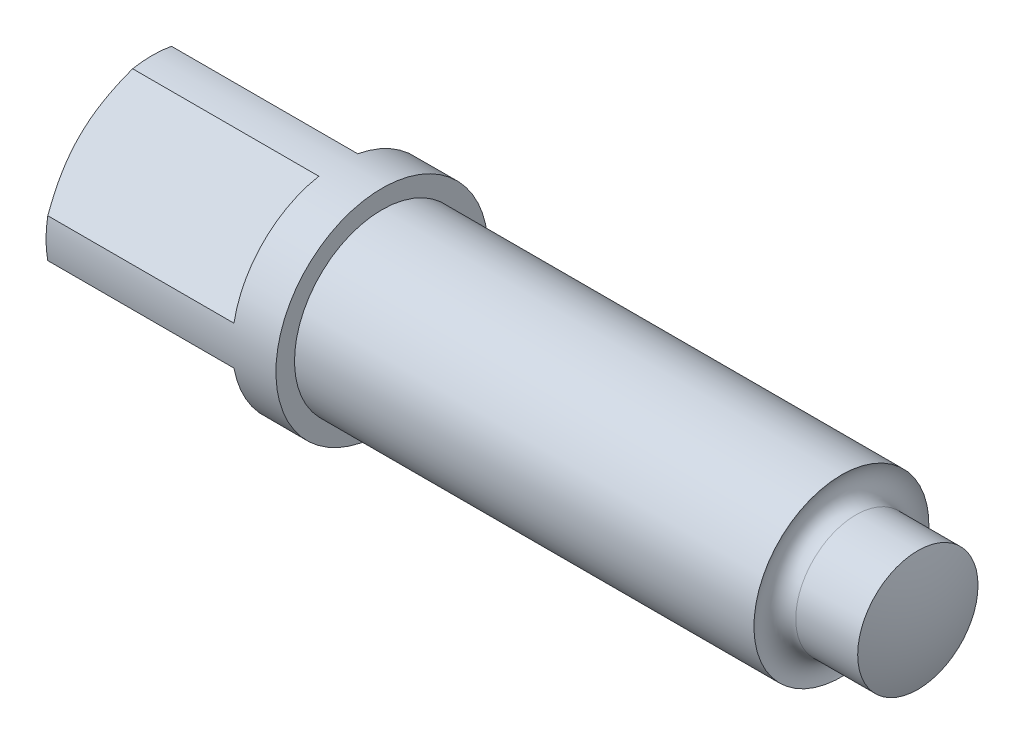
ISO-10303-21;
HEADER;
FILE_DESCRIPTION(('STEP AP214'),'2;1');
FILE_NAME('part.step','',(''),(''),'','','');
FILE_SCHEMA(('AUTOMOTIVE_DESIGN { 1 0 10303 214 1 1 1 1 }'));
ENDSEC;
DATA;
#1=APPLICATION_CONTEXT('core data for automotive mechanical design processes');
#2=APPLICATION_PROTOCOL_DEFINITION('international standard','automotive_design',2000,#1);
#3=PRODUCT_CONTEXT('',#1,'mechanical');
#4=PRODUCT('Part','Part','',(#3));
#5=PRODUCT_RELATED_PRODUCT_CATEGORY('part','',(#4));
#6=PRODUCT_DEFINITION_FORMATION('','',#4);
#7=PRODUCT_DEFINITION_CONTEXT('part definition',#1,'design');
#8=PRODUCT_DEFINITION('design','',#6,#7);
#9=PRODUCT_DEFINITION_SHAPE('','',#8);
#10=(LENGTH_UNIT() NAMED_UNIT(*) SI_UNIT(.MILLI.,.METRE.));
#11=(NAMED_UNIT(*) PLANE_ANGLE_UNIT() SI_UNIT($,.RADIAN.));
#12=(NAMED_UNIT(*) SI_UNIT($,.STERADIAN.) SOLID_ANGLE_UNIT());
#13=UNCERTAINTY_MEASURE_WITH_UNIT(LENGTH_MEASURE(1.E-05),#10,'distance_accuracy_value','');
#14=(GEOMETRIC_REPRESENTATION_CONTEXT(3) GLOBAL_UNCERTAINTY_ASSIGNED_CONTEXT((#13)) GLOBAL_UNIT_ASSIGNED_CONTEXT((#10,
#11,#12)) REPRESENTATION_CONTEXT('',''));
#15=CARTESIAN_POINT('',(0.,0.,0.));
#16=DIRECTION('',(0.,0.,1.));
#17=DIRECTION('',(1.,0.,0.));
#18=AXIS2_PLACEMENT_3D('',#15,#16,#17);
#19=CARTESIAN_POINT('',(11.,0.,0.));
#20=DIRECTION('',(1.,0.,0.));
#21=DIRECTION('',(0.,0.,-1.));
#22=AXIS2_PLACEMENT_3D('',#19,#20,#21);
#23=PLANE('',#22);
#24=CARTESIAN_POINT('',(11.,0.,0.));
#25=DIRECTION('',(1.,0.,0.));
#26=DIRECTION('',(0.,0.,-1.));
#27=AXIS2_PLACEMENT_3D('',#24,#25,#26);
#28=CIRCLE('',#27,4.85);
#29=CARTESIAN_POINT('',(11.,0.,-4.85));
#30=VERTEX_POINT('',#29);
#31=EDGE_CURVE('E381',#30,#30,#28,.T.);
#32=ORIENTED_EDGE('',*,*,#31,.T.);
#33=EDGE_LOOP('',(#32));
#34=FACE_BOUND('',#33,.T.);
#35=CARTESIAN_POINT('',(11.,0.,0.));
#36=DIRECTION('',(1.,0.,0.));
#37=DIRECTION('',(0.,1.,0.));
#38=AXIS2_PLACEMENT_3D('',#35,#36,#37);
#39=CIRCLE('',#38,4.);
#40=CARTESIAN_POINT('',(11.,4.,0.));
#41=VERTEX_POINT('',#40);
#42=EDGE_CURVE('E128',#41,#41,#39,.T.);
#43=ORIENTED_EDGE('',*,*,#42,.F.);
#44=EDGE_LOOP('',(#43));
#45=FACE_BOUND('',#44,.T.);
#46=ADVANCED_FACE('F36',(#34,#45),#23,.T.);
#47=CARTESIAN_POINT('',(11.,0.,0.));
#48=DIRECTION('',(-1.,0.,0.));
#49=DIRECTION('',(0.,0.,1.));
#50=AXIS2_PLACEMENT_3D('',#47,#48,#49);
#51=CYLINDRICAL_SURFACE('',#50,4.85);
#52=ORIENTED_EDGE('',*,*,#31,.F.);
#53=EDGE_LOOP('',(#52));
#54=FACE_BOUND('',#53,.T.);
#55=DIRECTION('',(-1.,0.,0.));
#56=VECTOR('',#55,1.);
#57=CARTESIAN_POINT('',(11.,0.889032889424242,4.76782136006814));
#58=LINE('',#57,#56);
#59=CARTESIAN_POINT('',(0.490747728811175,0.889032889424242,4.76782136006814));
#60=VERTEX_POINT('',#59);
#61=CARTESIAN_POINT('',(9.,0.889032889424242,4.76782136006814));
#62=VERTEX_POINT('',#61);
#63=EDGE_CURVE('E403',#60,#62,#58,.F.);
#64=ORIENTED_EDGE('',*,*,#63,.F.);
#65=CARTESIAN_POINT('',(0.490747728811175,0.,0.));
#66=DIRECTION('',(1.,0.,0.));
#67=DIRECTION('',(0.,1.,0.));
#68=AXIS2_PLACEMENT_3D('',#65,#66,#67);
#69=CIRCLE('',#68,4.85);
#70=CARTESIAN_POINT('',(0.490747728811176,-0.889032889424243,4.76782136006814));
#71=VERTEX_POINT('',#70);
#72=EDGE_CURVE('E137',#60,#71,#69,.T.);
#73=ORIENTED_EDGE('',*,*,#72,.T.);
#74=DIRECTION('',(-1.,0.,0.));
#75=VECTOR('',#74,1.);
#76=CARTESIAN_POINT('',(11.,-0.889032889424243,4.76782136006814));
#77=LINE('',#76,#75);
#78=CARTESIAN_POINT('',(9.,-0.889032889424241,4.76782136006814));
#79=VERTEX_POINT('',#78);
#80=EDGE_CURVE('E378',#79,#71,#77,.T.);
#81=ORIENTED_EDGE('',*,*,#80,.F.);
#82=CARTESIAN_POINT('',(9.,0.,0.));
#83=DIRECTION('',(-1.,0.,0.));
#84=DIRECTION('',(0.,0.,1.));
#85=AXIS2_PLACEMENT_3D('',#82,#83,#84);
#86=CIRCLE('',#85,4.85);
#87=CARTESIAN_POINT('',(9.,-4.76782136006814,0.889032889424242));
#88=VERTEX_POINT('',#87);
#89=EDGE_CURVE('E370',#88,#79,#86,.T.);
#90=ORIENTED_EDGE('',*,*,#89,.F.);
#91=DIRECTION('',(-1.,0.,0.));
#92=VECTOR('',#91,1.);
#93=CARTESIAN_POINT('',(11.,-4.76782136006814,0.889032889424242));
#94=LINE('',#93,#92);
#95=CARTESIAN_POINT('',(0.490747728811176,-4.76782136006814,0.889032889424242));
#96=VERTEX_POINT('',#95);
#97=EDGE_CURVE('E379',#96,#88,#94,.F.);
#98=ORIENTED_EDGE('',*,*,#97,.F.);
#99=CARTESIAN_POINT('',(0.490747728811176,-4.76782136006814,-0.889032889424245));
#100=VERTEX_POINT('',#99);
#101=EDGE_CURVE('E152',#96,#100,#69,.T.);
#102=ORIENTED_EDGE('',*,*,#101,.T.);
#103=DIRECTION('',(-1.,0.,0.));
#104=VECTOR('',#103,1.);
#105=CARTESIAN_POINT('',(11.,-4.76782136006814,-0.889032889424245));
#106=LINE('',#105,#104);
#107=CARTESIAN_POINT('',(9.,-4.76782136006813,-0.889032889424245));
#108=VERTEX_POINT('',#107);
#109=EDGE_CURVE('E385',#108,#100,#106,.T.);
#110=ORIENTED_EDGE('',*,*,#109,.F.);
#111=CARTESIAN_POINT('',(9.,-0.889032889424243,-4.76782136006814));
#112=VERTEX_POINT('',#111);
#113=EDGE_CURVE('E375',#112,#108,#86,.T.);
#114=ORIENTED_EDGE('',*,*,#113,.F.);
#115=DIRECTION('',(-1.,0.,0.));
#116=VECTOR('',#115,1.);
#117=CARTESIAN_POINT('',(11.,-0.889032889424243,-4.76782136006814));
#118=LINE('',#117,#116);
#119=CARTESIAN_POINT('',(0.490747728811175,-0.889032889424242,-4.76782136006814));
#120=VERTEX_POINT('',#119);
#121=EDGE_CURVE('E402',#120,#112,#118,.F.);
#122=ORIENTED_EDGE('',*,*,#121,.F.);
#123=CARTESIAN_POINT('',(0.490747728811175,0.889032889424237,-4.76782136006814));
#124=VERTEX_POINT('',#123);
#125=EDGE_CURVE('E140',#120,#124,#69,.T.);
#126=ORIENTED_EDGE('',*,*,#125,.T.);
#127=DIRECTION('',(-1.,0.,0.));
#128=VECTOR('',#127,1.);
#129=CARTESIAN_POINT('',(11.,0.889032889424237,-4.76782136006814));
#130=LINE('',#129,#128);
#131=CARTESIAN_POINT('',(9.,0.889032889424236,-4.76782136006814));
#132=VERTEX_POINT('',#131);
#133=EDGE_CURVE('E406',#132,#124,#130,.T.);
#134=ORIENTED_EDGE('',*,*,#133,.F.);
#135=CARTESIAN_POINT('',(9.,4.76782136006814,-0.889032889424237));
#136=VERTEX_POINT('',#135);
#137=EDGE_CURVE('E388',#136,#132,#86,.T.);
#138=ORIENTED_EDGE('',*,*,#137,.F.);
#139=DIRECTION('',(-1.,0.,0.));
#140=VECTOR('',#139,1.);
#141=CARTESIAN_POINT('',(11.,4.76782136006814,-0.889032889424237));
#142=LINE('',#141,#140);
#143=CARTESIAN_POINT('',(0.490747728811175,4.76782136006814,-0.889032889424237));
#144=VERTEX_POINT('',#143);
#145=EDGE_CURVE('E411',#144,#136,#142,.F.);
#146=ORIENTED_EDGE('',*,*,#145,.F.);
#147=CARTESIAN_POINT('',(0.490747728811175,4.76782136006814,0.889032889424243));
#148=VERTEX_POINT('',#147);
#149=EDGE_CURVE('E148',#144,#148,#69,.T.);
#150=ORIENTED_EDGE('',*,*,#149,.T.);
#151=DIRECTION('',(-1.,0.,0.));
#152=VECTOR('',#151,1.);
#153=CARTESIAN_POINT('',(11.,4.76782136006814,0.889032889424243));
#154=LINE('',#153,#152);
#155=CARTESIAN_POINT('',(9.,4.76782136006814,0.889032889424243));
#156=VERTEX_POINT('',#155);
#157=EDGE_CURVE('E147',#156,#148,#154,.T.);
#158=ORIENTED_EDGE('',*,*,#157,.F.);
#159=EDGE_CURVE('E376',#62,#156,#86,.T.);
#160=ORIENTED_EDGE('',*,*,#159,.F.);
#161=EDGE_LOOP('',(#64,#73,#81,#90,#98,#102,#110,#114,#122,#126,#134,#138,#146,#150,#158,#160));
#162=FACE_BOUND('',#161,.T.);
#163=ADVANCED_FACE('F38',(#54,#162),#51,.T.);
#164=CARTESIAN_POINT('',(9.,0.,5.65685424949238));
#165=DIRECTION('',(0.,0.707106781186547,0.707106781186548));
#166=DIRECTION('',(0.,-0.707106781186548,0.707106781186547));
#167=AXIS2_PLACEMENT_3D('',#164,#165,#166);
#168=PLANE('',#167);
#169=CARTESIAN_POINT('',(0.490840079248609,0.888832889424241,4.76802136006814));
#170=CARTESIAN_POINT('',(0.456412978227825,0.963399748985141,4.69345450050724));
#171=CARTESIAN_POINT('',(0.423195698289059,1.03824661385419,4.61860763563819));
#172=CARTESIAN_POINT('',(0.359560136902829,1.18855762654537,4.46829662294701));
#173=CARTESIAN_POINT('',(0.329142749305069,1.2640219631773,4.39283228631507));
#174=CARTESIAN_POINT('',(0.242500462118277,1.49185864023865,4.16499560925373));
#175=CARTESIAN_POINT('',(0.191119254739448,1.64518004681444,4.01167420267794));
#176=CARTESIAN_POINT('',(0.106153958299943,1.94970467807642,3.70714957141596));
#177=CARTESIAN_POINT('',(0.0720950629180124,2.10083951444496,3.55601473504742));
#178=CARTESIAN_POINT('',(0.0350019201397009,2.32854300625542,3.32831124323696));
#179=CARTESIAN_POINT('',(0.0249722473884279,2.404556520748,3.25229772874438));
#180=CARTESIAN_POINT('',(0.00980365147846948,2.55682448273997,3.10002976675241));
#181=CARTESIAN_POINT('',(0.00466426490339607,2.63307890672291,3.02377534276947));
#182=CARTESIAN_POINT('',(-0.000904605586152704,2.79528423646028,2.8615700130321));
#183=CARTESIAN_POINT('',(-0.0006595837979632,2.88124713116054,2.77560711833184));
#184=CARTESIAN_POINT('',(0.00621125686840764,3.05304624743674,2.60380800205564));
#185=CARTESIAN_POINT('',(0.0128373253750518,3.13888246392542,2.51797178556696));
#186=CARTESIAN_POINT('',(0.032257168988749,3.31037191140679,2.34648233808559));
#187=CARTESIAN_POINT('',(0.0450629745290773,3.39602445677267,2.26082979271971));
#188=CARTESIAN_POINT('',(0.0764283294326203,3.56680571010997,2.09004853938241));
#189=CARTESIAN_POINT('',(0.0949888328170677,3.65193432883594,2.00491992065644));
#190=CARTESIAN_POINT('',(0.159917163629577,3.91199768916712,1.74485656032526));
#191=CARTESIAN_POINT('',(0.214830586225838,4.08588513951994,1.57096910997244));
#192=CARTESIAN_POINT('',(0.309857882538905,4.34390084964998,1.3129533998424));
#193=CARTESIAN_POINT('',(0.343566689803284,4.42927622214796,1.22757802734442));
#194=CARTESIAN_POINT('',(0.414619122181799,4.59922442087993,1.05762982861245));
#195=CARTESIAN_POINT('',(0.451960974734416,4.683797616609,0.973056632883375));
#196=CARTESIAN_POINT('',(0.490840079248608,4.76802136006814,0.888832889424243));
#197=B_SPLINE_CURVE_WITH_KNOTS('',3,(#169,#170,#171,#172,#173,#174,#175,#176,#177,#178,#179,
#180,#181,#182,#183,#184,#185,#186,#187,#188,#189,#190,#191,#192,#193,#194,#195,#196),
.UNSPECIFIED.,.F.,.F.,(4,2,2,2,2,2,2,2,2,2,2,2,2,4),(0.,0.33278169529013,0.665669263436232,
1.33365378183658,1.98218098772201,2.30598344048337,2.62975520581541,2.99429336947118,
3.35884579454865,3.72411079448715,4.08943638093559,4.8443750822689,5.2204087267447,
5.59625981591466),.UNSPECIFIED.);
#198=CARTESIAN_POINT('',(0.,2.82842712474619,2.82842712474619));
#199=VERTEX_POINT('',#198);
#200=EDGE_CURVE('E133',#60,#199,#197,.T.);
#201=ORIENTED_EDGE('',*,*,#200,.F.);
#202=ORIENTED_EDGE('',*,*,#63,.T.);
#203=DIRECTION('',(0.,0.707106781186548,-0.707106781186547));
#204=VECTOR('',#203,1.);
#205=CARTESIAN_POINT('',(9.,0.,5.65685424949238));
#206=LINE('',#205,#204);
#207=EDGE_CURVE('E380',#62,#156,#206,.T.);
#208=ORIENTED_EDGE('',*,*,#207,.T.);
#209=ORIENTED_EDGE('',*,*,#157,.T.);
#210=EDGE_CURVE('E121',#199,#148,#197,.T.);
#211=ORIENTED_EDGE('',*,*,#210,.F.);
#212=EDGE_LOOP('',(#201,#202,#208,#209,#211));
#213=FACE_BOUND('',#212,.T.);
#214=ADVANCED_FACE('F144',(#213),#168,.T.);
#215=CARTESIAN_POINT('',(9.,0.,0.));
#216=DIRECTION('',(-1.,0.,0.));
#217=DIRECTION('',(0.,0.,1.));
#218=AXIS2_PLACEMENT_3D('',#215,#216,#217);
#219=PLANE('',#218);
#220=ORIENTED_EDGE('',*,*,#159,.T.);
#221=ORIENTED_EDGE('',*,*,#207,.F.);
#222=EDGE_LOOP('',(#220,#221));
#223=FACE_BOUND('',#222,.T.);
#224=ADVANCED_FACE('F192',(#223),#219,.T.);
#225=CARTESIAN_POINT('',(9.,5.65685424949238,0.));
#226=DIRECTION('',(0.,0.707106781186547,-0.707106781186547));
#227=DIRECTION('',(0.,0.707106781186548,0.707106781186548));
#228=AXIS2_PLACEMENT_3D('',#225,#226,#227);
#229=PLANE('',#228);
#230=CARTESIAN_POINT('',(0.490840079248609,4.76802136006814,-0.888832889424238));
#231=CARTESIAN_POINT('',(0.456412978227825,4.69345450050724,-0.963399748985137));
#232=CARTESIAN_POINT('',(0.423195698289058,4.61860763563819,-1.03824661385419));
#233=CARTESIAN_POINT('',(0.359560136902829,4.46829662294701,-1.18855762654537));
#234=CARTESIAN_POINT('',(0.329142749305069,4.39283228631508,-1.2640219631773));
#235=CARTESIAN_POINT('',(0.242500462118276,4.16499560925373,-1.49185864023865));
#236=CARTESIAN_POINT('',(0.191119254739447,4.01167420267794,-1.64518004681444));
#237=CARTESIAN_POINT('',(0.106153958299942,3.70714957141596,-1.94970467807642));
#238=CARTESIAN_POINT('',(0.0720950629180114,3.55601473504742,-2.10083951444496));
#239=CARTESIAN_POINT('',(0.0350019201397,3.32831124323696,-2.32854300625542));
#240=CARTESIAN_POINT('',(0.024972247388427,3.25229772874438,-2.40455652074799));
#241=CARTESIAN_POINT('',(0.00980365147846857,3.10002976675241,-2.55682448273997));
#242=CARTESIAN_POINT('',(0.00466426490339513,3.02377534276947,-2.63307890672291));
#243=CARTESIAN_POINT('',(-0.00090460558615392,2.8615700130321,-2.79528423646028));
#244=CARTESIAN_POINT('',(-0.000659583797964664,2.77560711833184,-2.88124713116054));
#245=CARTESIAN_POINT('',(0.00621125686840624,2.60380800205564,-3.05304624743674));
#246=CARTESIAN_POINT('',(0.0128373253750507,2.51797178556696,-3.13888246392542));
#247=CARTESIAN_POINT('',(0.032257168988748,2.34648233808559,-3.31037191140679));
#248=CARTESIAN_POINT('',(0.045062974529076,2.26082979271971,-3.39602445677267));
#249=CARTESIAN_POINT('',(0.0764283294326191,2.0900485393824,-3.56680571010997));
#250=CARTESIAN_POINT('',(0.094988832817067,2.00491992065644,-3.65193432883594));
#251=CARTESIAN_POINT('',(0.159917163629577,1.74485656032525,-3.91199768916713));
#252=CARTESIAN_POINT('',(0.214830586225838,1.57096910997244,-4.08588513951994));
#253=CARTESIAN_POINT('',(0.309857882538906,1.3129533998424,-4.34390084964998));
#254=CARTESIAN_POINT('',(0.343566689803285,1.22757802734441,-4.42927622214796));
#255=CARTESIAN_POINT('',(0.414619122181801,1.05762982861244,-4.59922442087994));
#256=CARTESIAN_POINT('',(0.451960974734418,0.973056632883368,-4.68379761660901));
#257=CARTESIAN_POINT('',(0.490840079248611,0.888832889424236,-4.76802136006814));
#258=B_SPLINE_CURVE_WITH_KNOTS('',3,(#230,#231,#232,#233,#234,#235,#236,#237,#238,#239,#240,
#241,#242,#243,#244,#245,#246,#247,#248,#249,#250,#251,#252,#253,#254,#255,#256,#257),
.UNSPECIFIED.,.F.,.F.,(4,2,2,2,2,2,2,2,2,2,2,2,2,4),(0.,0.33278169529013,0.665669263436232,
1.33365378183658,1.98218098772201,2.30598344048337,2.62975520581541,2.99429336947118,
3.35884579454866,3.72411079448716,4.08943638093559,4.84437508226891,5.22040872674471,
5.59625981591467),.UNSPECIFIED.);
#259=CARTESIAN_POINT('',(0.,2.82842712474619,-2.82842712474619));
#260=VERTEX_POINT('',#259);
#261=EDGE_CURVE('E124',#144,#260,#258,.T.);
#262=ORIENTED_EDGE('',*,*,#261,.F.);
#263=ORIENTED_EDGE('',*,*,#145,.T.);
#264=DIRECTION('',(0.,-0.707106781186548,-0.707106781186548));
#265=VECTOR('',#264,1.);
#266=CARTESIAN_POINT('',(9.,5.65685424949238,0.));
#267=LINE('',#266,#265);
#268=EDGE_CURVE('E404',#136,#132,#267,.T.);
#269=ORIENTED_EDGE('',*,*,#268,.T.);
#270=ORIENTED_EDGE('',*,*,#133,.T.);
#271=EDGE_CURVE('E181',#260,#124,#258,.T.);
#272=ORIENTED_EDGE('',*,*,#271,.F.);
#273=EDGE_LOOP('',(#262,#263,#269,#270,#272));
#274=FACE_BOUND('',#273,.T.);
#275=ADVANCED_FACE('F188',(#274),#229,.T.);
#276=ORIENTED_EDGE('',*,*,#137,.T.);
#277=ORIENTED_EDGE('',*,*,#268,.F.);
#278=EDGE_LOOP('',(#276,#277));
#279=FACE_BOUND('',#278,.T.);
#280=ADVANCED_FACE('F191',(#279),#219,.T.);
#281=CARTESIAN_POINT('',(9.,0.,-5.65685424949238));
#282=DIRECTION('',(0.,-0.707106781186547,-0.707106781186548));
#283=DIRECTION('',(0.,0.707106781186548,-0.707106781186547));
#284=AXIS2_PLACEMENT_3D('',#281,#282,#283);
#285=PLANE('',#284);
#286=CARTESIAN_POINT('',(0.490840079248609,-0.888832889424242,-4.76802136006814));
#287=CARTESIAN_POINT('',(0.456412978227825,-0.963399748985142,-4.69345450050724));
#288=CARTESIAN_POINT('',(0.423195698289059,-1.03824661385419,-4.61860763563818));
#289=CARTESIAN_POINT('',(0.359560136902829,-1.18855762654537,-4.46829662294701));
#290=CARTESIAN_POINT('',(0.329142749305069,-1.26402196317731,-4.39283228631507));
#291=CARTESIAN_POINT('',(0.242500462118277,-1.49185864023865,-4.16499560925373));
#292=CARTESIAN_POINT('',(0.191119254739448,-1.64518004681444,-4.01167420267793));
#293=CARTESIAN_POINT('',(0.106153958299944,-1.94970467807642,-3.70714957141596));
#294=CARTESIAN_POINT('',(0.0720950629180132,-2.10083951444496,-3.55601473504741));
#295=CARTESIAN_POINT('',(0.0350019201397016,-2.32854300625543,-3.32831124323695));
#296=CARTESIAN_POINT('',(0.0249722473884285,-2.404556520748,-3.25229772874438));
#297=CARTESIAN_POINT('',(0.00980365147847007,-2.55682448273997,-3.10002976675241));
#298=CARTESIAN_POINT('',(0.00466426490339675,-2.63307890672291,-3.02377534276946));
#299=CARTESIAN_POINT('',(-0.000904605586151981,-2.79528423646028,-2.8615700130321));
#300=CARTESIAN_POINT('',(-0.000659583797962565,-2.88124713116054,-2.77560711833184));
#301=CARTESIAN_POINT('',(0.00621125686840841,-3.05304624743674,-2.60380800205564));
#302=CARTESIAN_POINT('',(0.0128373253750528,-3.13888246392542,-2.51797178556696));
#303=CARTESIAN_POINT('',(0.0322571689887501,-3.31037191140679,-2.34648233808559));
#304=CARTESIAN_POINT('',(0.0450629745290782,-3.39602445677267,-2.26082979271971));
#305=CARTESIAN_POINT('',(0.0764283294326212,-3.56680571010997,-2.09004853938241));
#306=CARTESIAN_POINT('',(0.0949888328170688,-3.65193432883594,-2.00491992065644));
#307=CARTESIAN_POINT('',(0.159917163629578,-3.91199768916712,-1.74485656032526));
#308=CARTESIAN_POINT('',(0.214830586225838,-4.08588513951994,-1.57096910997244));
#309=CARTESIAN_POINT('',(0.309857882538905,-4.34390084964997,-1.31295339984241));
#310=CARTESIAN_POINT('',(0.343566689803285,-4.42927622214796,-1.22757802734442));
#311=CARTESIAN_POINT('',(0.4146191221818,-4.59922442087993,-1.05762982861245));
#312=CARTESIAN_POINT('',(0.451960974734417,-4.683797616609,-0.973056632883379));
#313=CARTESIAN_POINT('',(0.490840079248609,-4.76802136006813,-0.888832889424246));
#314=B_SPLINE_CURVE_WITH_KNOTS('',3,(#286,#287,#288,#289,#290,#291,#292,#293,#294,#295,#296,
#297,#298,#299,#300,#301,#302,#303,#304,#305,#306,#307,#308,#309,#310,#311,#312,#313),
.UNSPECIFIED.,.F.,.F.,(4,2,2,2,2,2,2,2,2,2,2,2,2,4),(0.,0.33278169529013,0.665669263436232,
1.33365378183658,1.98218098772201,2.30598344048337,2.62975520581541,2.99429336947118,
3.35884579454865,3.72411079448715,4.08943638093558,4.84437508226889,5.2204087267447,
5.59625981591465),.UNSPECIFIED.);
#315=CARTESIAN_POINT('',(0.,-2.82842712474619,-2.82842712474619));
#316=VERTEX_POINT('',#315);
#317=EDGE_CURVE('E141',#120,#316,#314,.T.);
#318=ORIENTED_EDGE('',*,*,#317,.F.);
#319=ORIENTED_EDGE('',*,*,#121,.T.);
#320=DIRECTION('',(0.,-0.707106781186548,0.707106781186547));
#321=VECTOR('',#320,1.);
#322=CARTESIAN_POINT('',(9.,0.,-5.65685424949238));
#323=LINE('',#322,#321);
#324=EDGE_CURVE('E397',#112,#108,#323,.T.);
#325=ORIENTED_EDGE('',*,*,#324,.T.);
#326=ORIENTED_EDGE('',*,*,#109,.T.);
#327=EDGE_CURVE('E158',#316,#100,#314,.T.);
#328=ORIENTED_EDGE('',*,*,#327,.F.);
#329=EDGE_LOOP('',(#318,#319,#325,#326,#328));
#330=FACE_BOUND('',#329,.T.);
#331=ADVANCED_FACE('F168',(#330),#285,.T.);
#332=ORIENTED_EDGE('',*,*,#113,.T.);
#333=ORIENTED_EDGE('',*,*,#324,.F.);
#334=EDGE_LOOP('',(#332,#333));
#335=FACE_BOUND('',#334,.T.);
#336=ADVANCED_FACE('F329',(#335),#219,.T.);
#337=ORIENTED_EDGE('',*,*,#89,.T.);
#338=DIRECTION('',(0.,0.707106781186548,0.707106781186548));
#339=VECTOR('',#338,1.);
#340=CARTESIAN_POINT('',(9.,-5.65685424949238,0.));
#341=LINE('',#340,#339);
#342=EDGE_CURVE('E186',#88,#79,#341,.T.);
#343=ORIENTED_EDGE('',*,*,#342,.F.);
#344=EDGE_LOOP('',(#337,#343));
#345=FACE_BOUND('',#344,.T.);
#346=ADVANCED_FACE('F200',(#345),#219,.T.);
#347=CARTESIAN_POINT('',(9.,-5.65685424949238,0.));
#348=DIRECTION('',(0.,-0.707106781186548,0.707106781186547));
#349=DIRECTION('',(0.,-0.707106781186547,-0.707106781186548));
#350=AXIS2_PLACEMENT_3D('',#347,#348,#349);
#351=PLANE('',#350);
#352=CARTESIAN_POINT('',(0.49084007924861,-4.76802136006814,0.888832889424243));
#353=CARTESIAN_POINT('',(0.456412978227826,-4.69345450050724,0.963399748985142));
#354=CARTESIAN_POINT('',(0.423195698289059,-4.61860763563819,1.03824661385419));
#355=CARTESIAN_POINT('',(0.35956013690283,-4.46829662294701,1.18855762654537));
#356=CARTESIAN_POINT('',(0.32914274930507,-4.39283228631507,1.26402196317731));
#357=CARTESIAN_POINT('',(0.242500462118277,-4.16499560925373,1.49185864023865));
#358=CARTESIAN_POINT('',(0.191119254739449,-4.01167420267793,1.64518004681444));
#359=CARTESIAN_POINT('',(0.106153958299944,-3.70714957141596,1.94970467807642));
#360=CARTESIAN_POINT('',(0.0720950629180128,-3.55601473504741,2.10083951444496));
#361=CARTESIAN_POINT('',(0.0350019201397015,-3.32831124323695,2.32854300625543));
#362=CARTESIAN_POINT('',(0.0249722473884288,-3.25229772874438,2.404556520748));
#363=CARTESIAN_POINT('',(0.00980365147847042,-3.10002976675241,2.55682448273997));
#364=CARTESIAN_POINT('',(0.0046642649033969,-3.02377534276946,2.63307890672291));
#365=CARTESIAN_POINT('',(-0.000904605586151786,-2.8615700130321,2.79528423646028));
#366=CARTESIAN_POINT('',(-0.000659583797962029,-2.77560711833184,2.88124713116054));
#367=CARTESIAN_POINT('',(0.00621125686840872,-2.60380800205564,3.05304624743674));
#368=CARTESIAN_POINT('',(0.0128373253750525,-2.51797178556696,3.13888246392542));
#369=CARTESIAN_POINT('',(0.0322571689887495,-2.34648233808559,3.31037191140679));
#370=CARTESIAN_POINT('',(0.045062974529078,-2.26082979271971,3.39602445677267));
#371=CARTESIAN_POINT('',(0.0764283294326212,-2.0900485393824,3.56680571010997));
#372=CARTESIAN_POINT('',(0.0949888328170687,-2.00491992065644,3.65193432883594));
#373=CARTESIAN_POINT('',(0.159917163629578,-1.74485656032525,3.91199768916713));
#374=CARTESIAN_POINT('',(0.214830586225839,-1.57096910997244,4.08588513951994));
#375=CARTESIAN_POINT('',(0.309857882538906,-1.3129533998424,4.34390084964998));
#376=CARTESIAN_POINT('',(0.343566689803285,-1.22757802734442,4.42927622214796));
#377=CARTESIAN_POINT('',(0.414619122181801,-1.05762982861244,4.59922442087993));
#378=CARTESIAN_POINT('',(0.451960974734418,-0.973056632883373,4.68379761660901));
#379=CARTESIAN_POINT('',(0.49084007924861,-0.888832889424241,4.76802136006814));
#380=B_SPLINE_CURVE_WITH_KNOTS('',3,(#352,#353,#354,#355,#356,#357,#358,#359,#360,#361,#362,
#363,#364,#365,#366,#367,#368,#369,#370,#371,#372,#373,#374,#375,#376,#377,#378,#379),
.UNSPECIFIED.,.F.,.F.,(4,2,2,2,2,2,2,2,2,2,2,2,2,4),(0.,0.33278169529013,0.665669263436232,
1.33365378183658,1.98218098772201,2.30598344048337,2.62975520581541,2.99429336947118,
3.35884579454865,3.72411079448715,4.08943638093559,4.8443750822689,5.2204087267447,
5.59625981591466),.UNSPECIFIED.);
#381=CARTESIAN_POINT('',(0.,-2.82842712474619,2.82842712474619));
#382=VERTEX_POINT('',#381);
#383=EDGE_CURVE('E12',#96,#382,#380,.T.);
#384=ORIENTED_EDGE('',*,*,#383,.F.);
#385=ORIENTED_EDGE('',*,*,#97,.T.);
#386=ORIENTED_EDGE('',*,*,#342,.T.);
#387=ORIENTED_EDGE('',*,*,#80,.T.);
#388=EDGE_CURVE('E40',#382,#71,#380,.T.);
#389=ORIENTED_EDGE('',*,*,#388,.F.);
#390=EDGE_LOOP('',(#384,#385,#386,#387,#389));
#391=FACE_BOUND('',#390,.T.);
#392=ADVANCED_FACE('F196',(#391),#351,.T.);
#393=CARTESIAN_POINT('',(0.,0.,0.));
#394=DIRECTION('',(1.,0.,0.));
#395=DIRECTION('',(0.,1.,0.));
#396=AXIS2_PLACEMENT_3D('',#393,#394,#395);
#397=CONICAL_SURFACE('',#396,4.,1.0471975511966);
#398=ORIENTED_EDGE('',*,*,#200,.T.);
#399=CARTESIAN_POINT('',(0.,0.,0.));
#400=DIRECTION('',(1.,0.,0.));
#401=DIRECTION('',(0.,1.,0.));
#402=AXIS2_PLACEMENT_3D('',#399,#400,#401);
#403=CIRCLE('',#402,4.);
#404=EDGE_CURVE('E130',#199,#382,#403,.T.);
#405=ORIENTED_EDGE('',*,*,#404,.T.);
#406=ORIENTED_EDGE('',*,*,#388,.T.);
#407=ORIENTED_EDGE('',*,*,#72,.F.);
#408=EDGE_LOOP('',(#398,#405,#406,#407));
#409=FACE_BOUND('',#408,.T.);
#410=ADVANCED_FACE('F134',(#409),#397,.T.);
#411=ORIENTED_EDGE('',*,*,#327,.T.);
#412=ORIENTED_EDGE('',*,*,#101,.F.);
#413=ORIENTED_EDGE('',*,*,#383,.T.);
#414=EDGE_CURVE('E151',#382,#316,#403,.T.);
#415=ORIENTED_EDGE('',*,*,#414,.T.);
#416=EDGE_LOOP('',(#411,#412,#413,#415));
#417=FACE_BOUND('',#416,.T.);
#418=ADVANCED_FACE('F171',(#417),#397,.T.);
#419=ORIENTED_EDGE('',*,*,#271,.T.);
#420=ORIENTED_EDGE('',*,*,#125,.F.);
#421=ORIENTED_EDGE('',*,*,#317,.T.);
#422=EDGE_CURVE('E56',#316,#260,#403,.T.);
#423=ORIENTED_EDGE('',*,*,#422,.T.);
#424=EDGE_LOOP('',(#419,#420,#421,#423));
#425=FACE_BOUND('',#424,.T.);
#426=ADVANCED_FACE('F175',(#425),#397,.T.);
#427=ORIENTED_EDGE('',*,*,#261,.T.);
#428=EDGE_CURVE('E117',#260,#199,#403,.T.);
#429=ORIENTED_EDGE('',*,*,#428,.T.);
#430=ORIENTED_EDGE('',*,*,#210,.T.);
#431=ORIENTED_EDGE('',*,*,#149,.F.);
#432=EDGE_LOOP('',(#427,#429,#430,#431));
#433=FACE_BOUND('',#432,.T.);
#434=ADVANCED_FACE('F119',(#433),#397,.T.);
#435=CARTESIAN_POINT('',(0.,0.,0.));
#436=DIRECTION('',(1.,0.,0.));
#437=DIRECTION('',(0.,0.,-1.));
#438=AXIS2_PLACEMENT_3D('',#435,#436,#437);
#439=PLANE('',#438);
#440=ORIENTED_EDGE('',*,*,#422,.F.);
#441=ORIENTED_EDGE('',*,*,#414,.F.);
#442=ORIENTED_EDGE('',*,*,#404,.F.);
#443=ORIENTED_EDGE('',*,*,#428,.F.);
#444=EDGE_LOOP('',(#440,#441,#442,#443));
#445=FACE_BOUND('',#444,.T.);
#446=ADVANCED_FACE('F150',(#445),#439,.F.);
#447=CARTESIAN_POINT('',(2.81638326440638,0.,0.));
#448=DIRECTION('',(1.,0.,0.));
#449=DIRECTION('',(0.,1.,0.));
#450=AXIS2_PLACEMENT_3D('',#447,#448,#449);
#451=CYLINDRICAL_SURFACE('',#450,4.);
#452=CARTESIAN_POINT('',(32.,0.,0.));
#453=DIRECTION('',(1.,0.,0.));
#454=DIRECTION('',(0.,1.,0.));
#455=AXIS2_PLACEMENT_3D('',#452,#453,#454);
#456=CIRCLE('',#455,4.);
#457=CARTESIAN_POINT('',(32.,4.00000000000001,0.));
#458=VERTEX_POINT('',#457);
#459=EDGE_CURVE('E294',#458,#458,#456,.T.);
#460=ORIENTED_EDGE('',*,*,#459,.F.);
#461=EDGE_LOOP('',(#460));
#462=FACE_BOUND('',#461,.T.);
#463=ORIENTED_EDGE('',*,*,#42,.T.);
#464=EDGE_LOOP('',(#463));
#465=FACE_BOUND('',#464,.T.);
#466=ADVANCED_FACE('F176',(#462,#465),#451,.T.);
#467=CARTESIAN_POINT('',(32.6614378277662,0.,0.));
#468=DIRECTION('',(1.,0.,0.));
#469=DIRECTION('',(0.,1.,0.));
#470=AXIS2_PLACEMENT_3D('',#467,#468,#469);
#471=TOROIDAL_SURFACE('',#470,3.55,0.8);
#472=CARTESIAN_POINT('',(32.6614378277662,0.,0.));
#473=DIRECTION('',(1.,0.,0.));
#474=DIRECTION('',(0.,1.,0.));
#475=AXIS2_PLACEMENT_3D('',#472,#473,#474);
#476=CIRCLE('',#475,2.75);
#477=CARTESIAN_POINT('',(32.6614378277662,2.75,0.));
#478=VERTEX_POINT('',#477);
#479=EDGE_CURVE('E291',#478,#478,#476,.T.);
#480=ORIENTED_EDGE('',*,*,#479,.F.);
#481=EDGE_LOOP('',(#480));
#482=FACE_BOUND('',#481,.T.);
#483=ORIENTED_EDGE('',*,*,#459,.T.);
#484=EDGE_LOOP('',(#483));
#485=FACE_BOUND('',#484,.T.);
#486=ADVANCED_FACE('F212',(#482,#485),#471,.F.);
#487=CARTESIAN_POINT('',(2.81638326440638,0.,0.));
#488=DIRECTION('',(1.,0.,0.));
#489=DIRECTION('',(0.,1.,0.));
#490=AXIS2_PLACEMENT_3D('',#487,#488,#489);
#491=CYLINDRICAL_SURFACE('',#490,2.75);
#492=CARTESIAN_POINT('',(35.4921832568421,0.,0.));
#493=DIRECTION('',(1.,0.,0.));
#494=DIRECTION('',(0.,1.,0.));
#495=AXIS2_PLACEMENT_3D('',#492,#493,#494);
#496=CIRCLE('',#495,2.75);
#497=CARTESIAN_POINT('',(35.4921832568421,2.75000000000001,0.));
#498=VERTEX_POINT('',#497);
#499=EDGE_CURVE('E290',#498,#498,#496,.T.);
#500=ORIENTED_EDGE('',*,*,#499,.F.);
#501=EDGE_LOOP('',(#500));
#502=FACE_BOUND('',#501,.T.);
#503=ORIENTED_EDGE('',*,*,#479,.T.);
#504=EDGE_LOOP('',(#503));
#505=FACE_BOUND('',#504,.T.);
#506=ADVANCED_FACE('F265',(#502,#505),#491,.T.);
#507=CARTESIAN_POINT('',(28.3,0.,0.));
#508=DIRECTION('',(1.,0.,0.));
#509=DIRECTION('',(0.,-1.,0.));
#510=AXIS2_PLACEMENT_3D('',#507,#508,#509);
#511=SPHERICAL_SURFACE('',#510,7.7);
#512=ORIENTED_EDGE('',*,*,#499,.T.);
#513=EDGE_LOOP('',(#512));
#514=FACE_BOUND('',#513,.T.);
#515=ADVANCED_FACE('F274',(#514),#511,.T.);
#516=CLOSED_SHELL('',(#46,#163,#214,#224,#275,#280,#331,#336,#346,#392,#410,#418,#426,#434,#446,
#466,#486,#506,#515));
#517=MANIFOLD_SOLID_BREP('B2',#516);
#518=ADVANCED_BREP_SHAPE_REPRESENTATION('',(#18,#517),#14);
#519=SHAPE_DEFINITION_REPRESENTATION(#9,#518);
ENDSEC;
END-ISO-10303-21;
